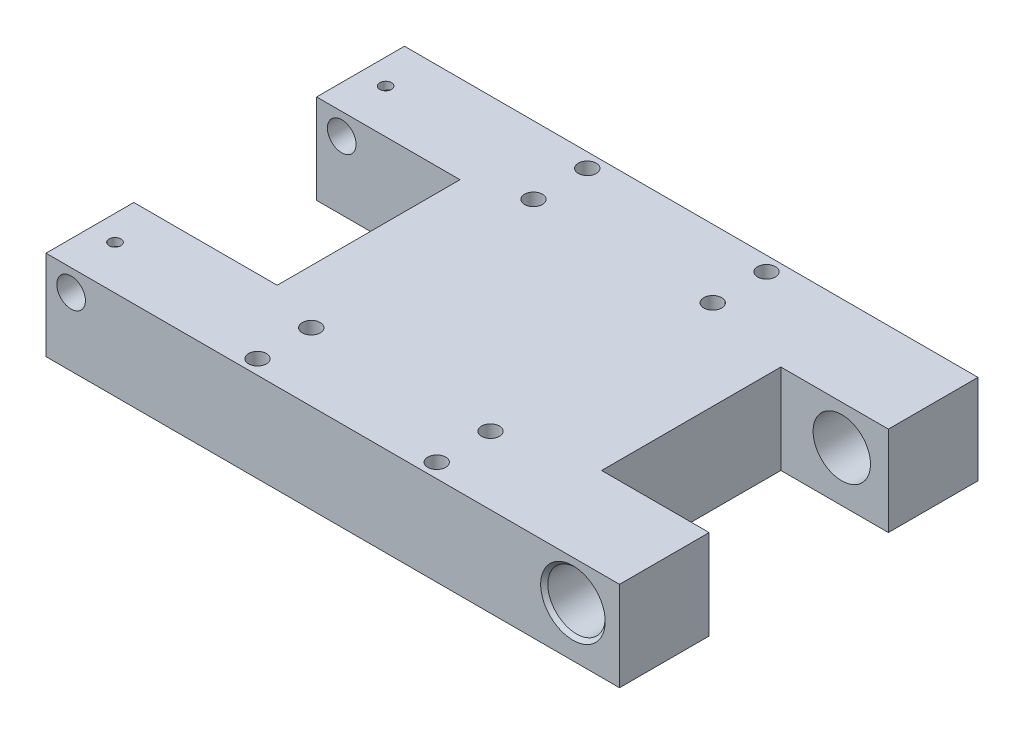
from build123d import *

# Parameters (mm, degrees)
ESQUISSE1_W               = 160
ESQUISSE1_H               = 25
EXTRUSION1_DEPTH          = 50
ESQUISSE2_R               = 4
ESQUISSE2_R_2             = 8
ENL_V_MAT_EXTRU_5_DEPTH   = 129.671092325
ESQUISSE3_W               = 50
ESQUISSE3_H               = 51
ESQUISSE3_W_2             = 40
ESQUISSE3_H_2             = 50
ENL_V_MAT_EXTRU_6_DEPTH   = 98.59610648
TROU_TARAUD_M4X0_71_D     = 3.3
TROU_TARAUD_M4X0_71_DEPTH = 10.1
TROU_TARAUD_M4X0_71_TIP   = 0.991420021
TROU_TARAUD_M6X1_01_D     = 5
CHANFREIN1_SIZE           = 1


with BuildPart() as part:
    # Esquisse1 → Extrusion1 (new, symmetric)
    with BuildSketch(Plane.XY):
        Rectangle(ESQUISSE1_W, ESQUISSE1_H)
    extrude(amount=EXTRUSION1_DEPTH, both=True)

    # Esquisse2 → Enl_v. mat.-Extru.5 (cut, through all)
    with BuildSketch(Plane.XY.offset(50)):
        with Locations((-73, 6.5)):
            Circle(ESQUISSE2_R)
        with Locations((67, 1.5)):
            Circle(ESQUISSE2_R_2)
    extrude(amount=-ENL_V_MAT_EXTRU_5_DEPTH, mode=Mode.SUBTRACT)

    # Esquisse3 → Enl_v. mat.-Extru.6 (cut, through all)
    with BuildSketch(Plane(origin=(0, 12.5, 0), x_dir=(-1, 0, 0), z_dir=(0, 1, 0))):
        with Locations((65, 0)):
            Rectangle(ESQUISSE3_W, ESQUISSE3_H)
        with Locations((-70, 0)):
            Rectangle(ESQUISSE3_W_2, ESQUISSE3_H_2)
    extrude(amount=-ENL_V_MAT_EXTRU_6_DEPTH, mode=Mode.SUBTRACT)

    # Trou taraud_ M4x0.71
    with Locations(Plane(origin=(0, 12.5, 0), x_dir=(-1, 0, 0), z_dir=(0, 1, 0))):
        with Locations((73, -37.75), (73, 37.75)):
            Hole(TROU_TARAUD_M4X0_71_D / 2, depth=TROU_TARAUD_M4X0_71_DEPTH)
            with Locations((0, 0, -(TROU_TARAUD_M4X0_71_DEPTH + TROU_TARAUD_M4X0_71_TIP / 2))):  # 118° drill point
                Cone(0, TROU_TARAUD_M4X0_71_D / 2, TROU_TARAUD_M4X0_71_TIP, mode=Mode.SUBTRACT)

    # Trou taraud_ M6x1.01 (through all)
    with Locations(Plane.XZ.offset(12.5)):
        with Locations((25, 31), (25, 46), (-25, 46), (-25, 31)):
            trou_taraud_m6x1_01 = Hole(TROU_TARAUD_M6X1_01_D / 2)

    # Chanfrein1
    chanfrein1_edges = [part.edges().sort_by_distance(p)[0] for p in [
        (59, 1.5, -50),
        (59, 1.5, 50),
    ]]
    chamfer(chanfrein1_edges, length=CHANFREIN1_SIZE)

    # Sym_trie1: Trou taraud_ M6x1.01 across plane
    add(trou_taraud_m6x1_01.mirror(Plane.XY), mode=Mode.SUBTRACT)


solid = part.part
